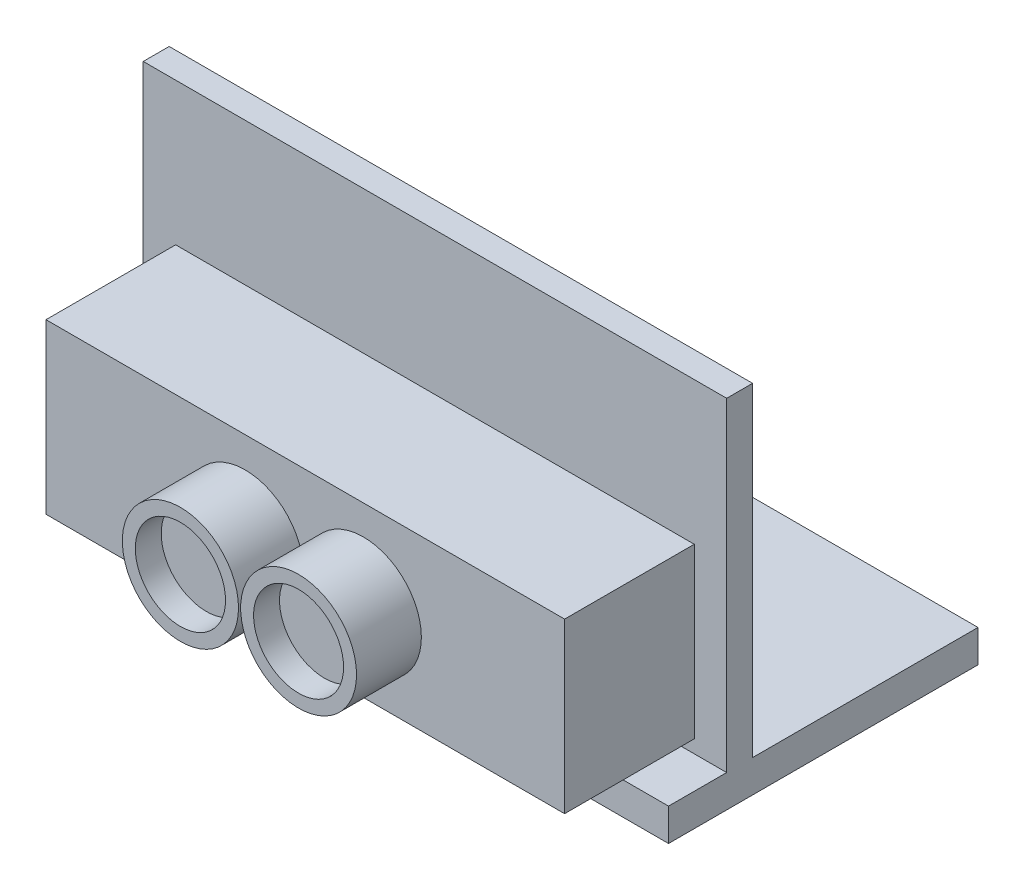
ISO-10303-21;
HEADER;
FILE_DESCRIPTION(('STEP AP214'),'2;1');
FILE_NAME('part.step','',(''),(''),'','','');
FILE_SCHEMA(('AUTOMOTIVE_DESIGN { 1 0 10303 214 1 1 1 1 }'));
ENDSEC;
DATA;
#1=APPLICATION_CONTEXT('core data for automotive mechanical design processes');
#2=APPLICATION_PROTOCOL_DEFINITION('international standard','automotive_design',2000,#1);
#3=PRODUCT_CONTEXT('',#1,'mechanical');
#4=PRODUCT('Part','Part','',(#3));
#5=PRODUCT_RELATED_PRODUCT_CATEGORY('part','',(#4));
#6=PRODUCT_DEFINITION_FORMATION('','',#4);
#7=PRODUCT_DEFINITION_CONTEXT('part definition',#1,'design');
#8=PRODUCT_DEFINITION('design','',#6,#7);
#9=PRODUCT_DEFINITION_SHAPE('','',#8);
#10=(LENGTH_UNIT() NAMED_UNIT(*) SI_UNIT(.MILLI.,.METRE.));
#11=(NAMED_UNIT(*) PLANE_ANGLE_UNIT() SI_UNIT($,.RADIAN.));
#12=(NAMED_UNIT(*) SI_UNIT($,.STERADIAN.) SOLID_ANGLE_UNIT());
#13=UNCERTAINTY_MEASURE_WITH_UNIT(LENGTH_MEASURE(1.E-05),#10,'distance_accuracy_value','');
#14=(GEOMETRIC_REPRESENTATION_CONTEXT(3) GLOBAL_UNCERTAINTY_ASSIGNED_CONTEXT((#13)) GLOBAL_UNIT_ASSIGNED_CONTEXT((#10,
#11,#12)) REPRESENTATION_CONTEXT('',''));
#15=CARTESIAN_POINT('',(0.,0.,0.));
#16=DIRECTION('',(0.,0.,1.));
#17=DIRECTION('',(1.,0.,0.));
#18=AXIS2_PLACEMENT_3D('',#15,#16,#17);
#19=CARTESIAN_POINT('',(0.,0.,2.));
#20=DIRECTION('',(0.,0.,1.));
#21=DIRECTION('',(1.,0.,0.));
#22=AXIS2_PLACEMENT_3D('',#19,#20,#21);
#23=PLANE('',#22);
#24=DIRECTION('',(0.,1.,0.));
#25=VECTOR('',#24,1.);
#26=CARTESIAN_POINT('',(22.5,12.5,2.));
#27=LINE('',#26,#25);
#28=CARTESIAN_POINT('',(22.5,-12.5,2.));
#29=VERTEX_POINT('',#28);
#30=CARTESIAN_POINT('',(22.5,12.5,2.));
#31=VERTEX_POINT('',#30);
#32=EDGE_CURVE('E242',#29,#31,#27,.T.);
#33=ORIENTED_EDGE('',*,*,#32,.T.);
#34=DIRECTION('',(-1.,0.,0.));
#35=VECTOR('',#34,1.);
#36=CARTESIAN_POINT('',(-22.5,12.5,2.));
#37=LINE('',#36,#35);
#38=CARTESIAN_POINT('',(-22.5,12.5,2.));
#39=VERTEX_POINT('',#38);
#40=EDGE_CURVE('E85',#31,#39,#37,.T.);
#41=ORIENTED_EDGE('',*,*,#40,.T.);
#42=DIRECTION('',(0.,-1.,0.));
#43=VECTOR('',#42,1.);
#44=CARTESIAN_POINT('',(-22.5,12.5,2.));
#45=LINE('',#44,#43);
#46=CARTESIAN_POINT('',(-22.5,-12.5,1.99999999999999));
#47=VERTEX_POINT('',#46);
#48=EDGE_CURVE('E248',#39,#47,#45,.T.);
#49=ORIENTED_EDGE('',*,*,#48,.T.);
#50=DIRECTION('',(1.,0.,0.));
#51=VECTOR('',#50,1.);
#52=CARTESIAN_POINT('',(-22.5,-12.5,2.));
#53=LINE('',#52,#51);
#54=EDGE_CURVE('E252',#47,#29,#53,.T.);
#55=ORIENTED_EDGE('',*,*,#54,.T.);
#56=EDGE_LOOP('',(#33,#41,#49,#55));
#57=FACE_BOUND('',#56,.T.);
#58=DIRECTION('',(-1.,0.,0.));
#59=VECTOR('',#58,1.);
#60=CARTESIAN_POINT('',(-20.,1.5,2.));
#61=LINE('',#60,#59);
#62=CARTESIAN_POINT('',(20.,1.5,2.));
#63=VERTEX_POINT('',#62);
#64=CARTESIAN_POINT('',(-20.,1.5,2.));
#65=VERTEX_POINT('',#64);
#66=EDGE_CURVE('E221',#63,#65,#61,.T.);
#67=ORIENTED_EDGE('',*,*,#66,.F.);
#68=DIRECTION('',(0.,1.,0.));
#69=VECTOR('',#68,1.);
#70=CARTESIAN_POINT('',(20.,1.5,2.));
#71=LINE('',#70,#69);
#72=CARTESIAN_POINT('',(20.,-11.5,2.));
#73=VERTEX_POINT('',#72);
#74=EDGE_CURVE('E201',#73,#63,#71,.T.);
#75=ORIENTED_EDGE('',*,*,#74,.F.);
#76=DIRECTION('',(1.,0.,0.));
#77=VECTOR('',#76,1.);
#78=CARTESIAN_POINT('',(-20.,-11.5,2.));
#79=LINE('',#78,#77);
#80=CARTESIAN_POINT('',(-20.,-11.5,2.));
#81=VERTEX_POINT('',#80);
#82=EDGE_CURVE('E208',#81,#73,#79,.T.);
#83=ORIENTED_EDGE('',*,*,#82,.F.);
#84=DIRECTION('',(0.,-1.,0.));
#85=VECTOR('',#84,1.);
#86=CARTESIAN_POINT('',(-20.,1.5,2.));
#87=LINE('',#86,#85);
#88=EDGE_CURVE('E224',#65,#81,#87,.T.);
#89=ORIENTED_EDGE('',*,*,#88,.F.);
#90=EDGE_LOOP('',(#67,#75,#83,#89));
#91=FACE_BOUND('',#90,.T.);
#92=ADVANCED_FACE('F41',(#57,#91),#23,.T.);
#93=CARTESIAN_POINT('',(22.5,12.5,2.));
#94=DIRECTION('',(-1.,0.,0.));
#95=DIRECTION('',(0.,-1.,0.));
#96=AXIS2_PLACEMENT_3D('',#93,#94,#95);
#97=PLANE('',#96);
#98=DIRECTION('',(0.,1.,0.));
#99=VECTOR('',#98,1.);
#100=CARTESIAN_POINT('',(22.5,12.5,0.));
#101=LINE('',#100,#99);
#102=CARTESIAN_POINT('',(22.5,-12.5,0.));
#103=VERTEX_POINT('',#102);
#104=CARTESIAN_POINT('',(22.5,12.5,0.));
#105=VERTEX_POINT('',#104);
#106=EDGE_CURVE('E241',#103,#105,#101,.T.);
#107=ORIENTED_EDGE('',*,*,#106,.T.);
#108=DIRECTION('',(0.,0.,-1.));
#109=VECTOR('',#108,1.);
#110=CARTESIAN_POINT('',(22.5,12.5,2.));
#111=LINE('',#110,#109);
#112=EDGE_CURVE('E45',#31,#105,#111,.T.);
#113=ORIENTED_EDGE('',*,*,#112,.F.);
#114=ORIENTED_EDGE('',*,*,#32,.F.);
#115=DIRECTION('',(0.,0.,1.));
#116=VECTOR('',#115,1.);
#117=CARTESIAN_POINT('',(22.5,-12.5,-17.3854720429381));
#118=LINE('',#117,#116);
#119=CARTESIAN_POINT('',(22.5,-12.5,6.48512200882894));
#120=VERTEX_POINT('',#119);
#121=EDGE_CURVE('E67',#29,#120,#118,.T.);
#122=ORIENTED_EDGE('',*,*,#121,.T.);
#123=DIRECTION('',(0.,1.,0.));
#124=VECTOR('',#123,1.);
#125=CARTESIAN_POINT('',(22.5,-15.,6.48512200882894));
#126=LINE('',#125,#124);
#127=CARTESIAN_POINT('',(22.5,-15.,6.48512200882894));
#128=VERTEX_POINT('',#127);
#129=EDGE_CURVE('E175',#128,#120,#126,.T.);
#130=ORIENTED_EDGE('',*,*,#129,.F.);
#131=DIRECTION('',(0.,0.,1.));
#132=VECTOR('',#131,1.);
#133=CARTESIAN_POINT('',(22.5,-15.,-17.3854720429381));
#134=LINE('',#133,#132);
#135=CARTESIAN_POINT('',(22.5,-15.,-17.3854720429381));
#136=VERTEX_POINT('',#135);
#137=EDGE_CURVE('E150',#136,#128,#134,.T.);
#138=ORIENTED_EDGE('',*,*,#137,.F.);
#139=DIRECTION('',(0.,1.,0.));
#140=VECTOR('',#139,1.);
#141=CARTESIAN_POINT('',(22.5,-15.,-17.3854720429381));
#142=LINE('',#141,#140);
#143=CARTESIAN_POINT('',(22.5,-12.5,-17.3854720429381));
#144=VERTEX_POINT('',#143);
#145=EDGE_CURVE('E146',#136,#144,#142,.T.);
#146=ORIENTED_EDGE('',*,*,#145,.T.);
#147=EDGE_CURVE('E276',#144,#103,#118,.T.);
#148=ORIENTED_EDGE('',*,*,#147,.T.);
#149=EDGE_LOOP('',(#107,#113,#114,#122,#130,#138,#146,#148));
#150=FACE_BOUND('',#149,.T.);
#151=ADVANCED_FACE('F43',(#150),#97,.F.);
#152=CARTESIAN_POINT('',(-22.5,12.5,2.));
#153=DIRECTION('',(0.,-1.,0.));
#154=DIRECTION('',(0.,0.,-1.));
#155=AXIS2_PLACEMENT_3D('',#152,#153,#154);
#156=PLANE('',#155);
#157=DIRECTION('',(-1.,0.,0.));
#158=VECTOR('',#157,1.);
#159=CARTESIAN_POINT('',(-22.5,12.5,0.));
#160=LINE('',#159,#158);
#161=CARTESIAN_POINT('',(-22.5,12.5,0.));
#162=VERTEX_POINT('',#161);
#163=EDGE_CURVE('E82',#105,#162,#160,.T.);
#164=ORIENTED_EDGE('',*,*,#163,.T.);
#165=DIRECTION('',(0.,0.,-1.));
#166=VECTOR('',#165,1.);
#167=CARTESIAN_POINT('',(-22.5,12.5,2.));
#168=LINE('',#167,#166);
#169=EDGE_CURVE('E255',#39,#162,#168,.T.);
#170=ORIENTED_EDGE('',*,*,#169,.F.);
#171=ORIENTED_EDGE('',*,*,#40,.F.);
#172=ORIENTED_EDGE('',*,*,#112,.T.);
#173=EDGE_LOOP('',(#164,#170,#171,#172));
#174=FACE_BOUND('',#173,.T.);
#175=ADVANCED_FACE('F270',(#174),#156,.F.);
#176=CARTESIAN_POINT('',(-22.5,12.5,2.));
#177=DIRECTION('',(1.,0.,0.));
#178=DIRECTION('',(0.,1.,0.));
#179=AXIS2_PLACEMENT_3D('',#176,#177,#178);
#180=PLANE('',#179);
#181=DIRECTION('',(0.,-1.,0.));
#182=VECTOR('',#181,1.);
#183=CARTESIAN_POINT('',(-22.5,12.5,0.));
#184=LINE('',#183,#182);
#185=CARTESIAN_POINT('',(-22.5,-12.5,0.));
#186=VERTEX_POINT('',#185);
#187=EDGE_CURVE('E261',#162,#186,#184,.T.);
#188=ORIENTED_EDGE('',*,*,#187,.T.);
#189=DIRECTION('',(0.,0.,-1.));
#190=VECTOR('',#189,1.);
#191=CARTESIAN_POINT('',(-22.5,-12.5,-17.3854720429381));
#192=LINE('',#191,#190);
#193=CARTESIAN_POINT('',(-22.5,-12.5,-17.3854720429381));
#194=VERTEX_POINT('',#193);
#195=EDGE_CURVE('E165',#186,#194,#192,.T.);
#196=ORIENTED_EDGE('',*,*,#195,.T.);
#197=DIRECTION('',(0.,1.,0.));
#198=VECTOR('',#197,1.);
#199=CARTESIAN_POINT('',(-22.5,-15.,-17.3854720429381));
#200=LINE('',#199,#198);
#201=CARTESIAN_POINT('',(-22.5,-15.,-17.3854720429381));
#202=VERTEX_POINT('',#201);
#203=EDGE_CURVE('E144',#202,#194,#200,.T.);
#204=ORIENTED_EDGE('',*,*,#203,.F.);
#205=DIRECTION('',(0.,0.,-1.));
#206=VECTOR('',#205,1.);
#207=CARTESIAN_POINT('',(-22.5,-15.,-17.3854720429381));
#208=LINE('',#207,#206);
#209=CARTESIAN_POINT('',(-22.5,-15.,6.48512200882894));
#210=VERTEX_POINT('',#209);
#211=EDGE_CURVE('E151',#210,#202,#208,.T.);
#212=ORIENTED_EDGE('',*,*,#211,.F.);
#213=DIRECTION('',(0.,1.,0.));
#214=VECTOR('',#213,1.);
#215=CARTESIAN_POINT('',(-22.5,-15.,6.48512200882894));
#216=LINE('',#215,#214);
#217=CARTESIAN_POINT('',(-22.5,-12.5,6.48512200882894));
#218=VERTEX_POINT('',#217);
#219=EDGE_CURVE('E302',#210,#218,#216,.T.);
#220=ORIENTED_EDGE('',*,*,#219,.T.);
#221=EDGE_CURVE('E284',#218,#47,#192,.T.);
#222=ORIENTED_EDGE('',*,*,#221,.T.);
#223=ORIENTED_EDGE('',*,*,#48,.F.);
#224=ORIENTED_EDGE('',*,*,#169,.T.);
#225=EDGE_LOOP('',(#188,#196,#204,#212,#220,#222,#223,#224));
#226=FACE_BOUND('',#225,.T.);
#227=ADVANCED_FACE('F164',(#226),#180,.F.);
#228=CARTESIAN_POINT('',(0.,0.,0.));
#229=DIRECTION('',(0.,0.,1.));
#230=DIRECTION('',(1.,0.,0.));
#231=AXIS2_PLACEMENT_3D('',#228,#229,#230);
#232=PLANE('',#231);
#233=ORIENTED_EDGE('',*,*,#106,.F.);
#234=DIRECTION('',(1.,0.,0.));
#235=VECTOR('',#234,1.);
#236=CARTESIAN_POINT('',(-22.5,-12.5,0.));
#237=LINE('',#236,#235);
#238=EDGE_CURVE('E245',#186,#103,#237,.T.);
#239=ORIENTED_EDGE('',*,*,#238,.F.);
#240=ORIENTED_EDGE('',*,*,#187,.F.);
#241=ORIENTED_EDGE('',*,*,#163,.F.);
#242=EDGE_LOOP('',(#233,#239,#240,#241));
#243=FACE_BOUND('',#242,.T.);
#244=ADVANCED_FACE('F279',(#243),#232,.F.);
#245=CARTESIAN_POINT('',(20.,1.5,12.));
#246=DIRECTION('',(-1.,0.,0.));
#247=DIRECTION('',(0.,0.,1.));
#248=AXIS2_PLACEMENT_3D('',#245,#246,#247);
#249=PLANE('',#248);
#250=ORIENTED_EDGE('',*,*,#74,.T.);
#251=DIRECTION('',(0.,0.,-1.));
#252=VECTOR('',#251,1.);
#253=CARTESIAN_POINT('',(20.,1.5,12.));
#254=LINE('',#253,#252);
#255=CARTESIAN_POINT('',(20.,1.5,12.));
#256=VERTEX_POINT('',#255);
#257=EDGE_CURVE('E238',#256,#63,#254,.T.);
#258=ORIENTED_EDGE('',*,*,#257,.F.);
#259=DIRECTION('',(0.,1.,0.));
#260=VECTOR('',#259,1.);
#261=CARTESIAN_POINT('',(20.,1.5,12.));
#262=LINE('',#261,#260);
#263=CARTESIAN_POINT('',(20.,-11.5,12.));
#264=VERTEX_POINT('',#263);
#265=EDGE_CURVE('E203',#264,#256,#262,.T.);
#266=ORIENTED_EDGE('',*,*,#265,.F.);
#267=DIRECTION('',(0.,0.,-1.));
#268=VECTOR('',#267,1.);
#269=CARTESIAN_POINT('',(20.,-11.5,12.));
#270=LINE('',#269,#268);
#271=EDGE_CURVE('E217',#264,#73,#270,.T.);
#272=ORIENTED_EDGE('',*,*,#271,.T.);
#273=EDGE_LOOP('',(#250,#258,#266,#272));
#274=FACE_BOUND('',#273,.T.);
#275=ADVANCED_FACE('F343',(#274),#249,.F.);
#276=CARTESIAN_POINT('',(-20.,1.5,12.));
#277=DIRECTION('',(0.,-1.,0.));
#278=DIRECTION('',(0.,0.,-1.));
#279=AXIS2_PLACEMENT_3D('',#276,#277,#278);
#280=PLANE('',#279);
#281=ORIENTED_EDGE('',*,*,#66,.T.);
#282=DIRECTION('',(0.,0.,-1.));
#283=VECTOR('',#282,1.);
#284=CARTESIAN_POINT('',(-20.,1.5,12.));
#285=LINE('',#284,#283);
#286=CARTESIAN_POINT('',(-20.,1.5,12.));
#287=VERTEX_POINT('',#286);
#288=EDGE_CURVE('E234',#287,#65,#285,.T.);
#289=ORIENTED_EDGE('',*,*,#288,.F.);
#290=DIRECTION('',(-1.,0.,0.));
#291=VECTOR('',#290,1.);
#292=CARTESIAN_POINT('',(-20.,1.5,12.));
#293=LINE('',#292,#291);
#294=EDGE_CURVE('E207',#256,#287,#293,.T.);
#295=ORIENTED_EDGE('',*,*,#294,.F.);
#296=ORIENTED_EDGE('',*,*,#257,.T.);
#297=EDGE_LOOP('',(#281,#289,#295,#296));
#298=FACE_BOUND('',#297,.T.);
#299=ADVANCED_FACE('F368',(#298),#280,.F.);
#300=CARTESIAN_POINT('',(-20.,1.5,12.));
#301=DIRECTION('',(1.,0.,0.));
#302=DIRECTION('',(0.,1.,0.));
#303=AXIS2_PLACEMENT_3D('',#300,#301,#302);
#304=PLANE('',#303);
#305=ORIENTED_EDGE('',*,*,#88,.T.);
#306=DIRECTION('',(0.,0.,-1.));
#307=VECTOR('',#306,1.);
#308=CARTESIAN_POINT('',(-20.,-11.5,12.));
#309=LINE('',#308,#307);
#310=CARTESIAN_POINT('',(-20.,-11.5,12.));
#311=VERTEX_POINT('',#310);
#312=EDGE_CURVE('E58',#311,#81,#309,.T.);
#313=ORIENTED_EDGE('',*,*,#312,.F.);
#314=DIRECTION('',(0.,-1.,0.));
#315=VECTOR('',#314,1.);
#316=CARTESIAN_POINT('',(-20.,1.5,12.));
#317=LINE('',#316,#315);
#318=EDGE_CURVE('E211',#287,#311,#317,.T.);
#319=ORIENTED_EDGE('',*,*,#318,.F.);
#320=ORIENTED_EDGE('',*,*,#288,.T.);
#321=EDGE_LOOP('',(#305,#313,#319,#320));
#322=FACE_BOUND('',#321,.T.);
#323=ADVANCED_FACE('F375',(#322),#304,.F.);
#324=CARTESIAN_POINT('',(-20.,-11.5,12.));
#325=DIRECTION('',(0.,1.,0.));
#326=DIRECTION('',(0.,0.,1.));
#327=AXIS2_PLACEMENT_3D('',#324,#325,#326);
#328=PLANE('',#327);
#329=ORIENTED_EDGE('',*,*,#82,.T.);
#330=ORIENTED_EDGE('',*,*,#271,.F.);
#331=DIRECTION('',(1.,0.,0.));
#332=VECTOR('',#331,1.);
#333=CARTESIAN_POINT('',(-20.,-11.5,12.));
#334=LINE('',#333,#332);
#335=EDGE_CURVE('E214',#311,#264,#334,.T.);
#336=ORIENTED_EDGE('',*,*,#335,.F.);
#337=ORIENTED_EDGE('',*,*,#312,.T.);
#338=EDGE_LOOP('',(#329,#330,#336,#337));
#339=FACE_BOUND('',#338,.T.);
#340=ADVANCED_FACE('F382',(#339),#328,.F.);
#341=CARTESIAN_POINT('',(0.,0.,12.));
#342=DIRECTION('',(0.,0.,1.));
#343=DIRECTION('',(1.,0.,0.));
#344=AXIS2_PLACEMENT_3D('',#341,#342,#343);
#345=PLANE('',#344);
#346=CARTESIAN_POINT('',(-4.63299444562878,-5.33090468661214,12.));
#347=DIRECTION('',(0.,0.,1.));
#348=DIRECTION('',(1.,0.,0.));
#349=AXIS2_PLACEMENT_3D('',#346,#347,#348);
#350=CIRCLE('',#349,4.48016591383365);
#351=CARTESIAN_POINT('',(-0.15282853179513,-5.33090468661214,12.));
#352=VERTEX_POINT('',#351);
#353=EDGE_CURVE('E183',#352,#352,#350,.T.);
#354=ORIENTED_EDGE('',*,*,#353,.F.);
#355=EDGE_LOOP('',(#354));
#356=FACE_BOUND('',#355,.T.);
#357=CARTESIAN_POINT('',(4.48185602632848,-5.24068472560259,12.));
#358=DIRECTION('',(0.,0.,1.));
#359=DIRECTION('',(1.,0.,0.));
#360=AXIS2_PLACEMENT_3D('',#357,#358,#359);
#361=CIRCLE('',#360,4.46981720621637);
#362=CARTESIAN_POINT('',(8.95167323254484,-5.24068472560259,12.));
#363=VERTEX_POINT('',#362);
#364=EDGE_CURVE('E11',#363,#363,#361,.T.);
#365=ORIENTED_EDGE('',*,*,#364,.F.);
#366=EDGE_LOOP('',(#365));
#367=FACE_BOUND('',#366,.T.);
#368=ORIENTED_EDGE('',*,*,#265,.T.);
#369=ORIENTED_EDGE('',*,*,#294,.T.);
#370=ORIENTED_EDGE('',*,*,#318,.T.);
#371=ORIENTED_EDGE('',*,*,#335,.T.);
#372=EDGE_LOOP('',(#368,#369,#370,#371));
#373=FACE_BOUND('',#372,.T.);
#374=ADVANCED_FACE('F390',(#356,#367,#373),#345,.T.);
#375=CARTESIAN_POINT('',(4.48185602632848,-5.24068472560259,17.));
#376=DIRECTION('',(0.,0.,-1.));
#377=DIRECTION('',(-1.,0.,0.));
#378=AXIS2_PLACEMENT_3D('',#375,#376,#377);
#379=CYLINDRICAL_SURFACE('',#378,4.46981720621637);
#380=CARTESIAN_POINT('',(4.48185602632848,-5.24068472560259,17.));
#381=DIRECTION('',(0.,0.,1.));
#382=DIRECTION('',(1.,0.,0.));
#383=AXIS2_PLACEMENT_3D('',#380,#381,#382);
#384=CIRCLE('',#383,4.46981720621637);
#385=CARTESIAN_POINT('',(8.95167323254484,-5.24068472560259,17.));
#386=VERTEX_POINT('',#385);
#387=EDGE_CURVE('E195',#386,#386,#384,.T.);
#388=ORIENTED_EDGE('',*,*,#387,.F.);
#389=EDGE_LOOP('',(#388));
#390=FACE_BOUND('',#389,.T.);
#391=ORIENTED_EDGE('',*,*,#364,.T.);
#392=EDGE_LOOP('',(#391));
#393=FACE_BOUND('',#392,.T.);
#394=ADVANCED_FACE('F397',(#390,#393),#379,.T.);
#395=CARTESIAN_POINT('',(4.48185602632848,-5.24068472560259,17.));
#396=DIRECTION('',(0.,0.,1.));
#397=DIRECTION('',(1.,0.,0.));
#398=AXIS2_PLACEMENT_3D('',#395,#396,#397);
#399=PLANE('',#398);
#400=CARTESIAN_POINT('',(4.48185602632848,-5.24068472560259,17.));
#401=DIRECTION('',(0.,0.,1.));
#402=DIRECTION('',(1.,0.,0.));
#403=AXIS2_PLACEMENT_3D('',#400,#401,#402);
#404=CIRCLE('',#403,3.46981720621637);
#405=CARTESIAN_POINT('',(7.95167323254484,-5.24068472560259,17.));
#406=VERTEX_POINT('',#405);
#407=EDGE_CURVE('E184',#406,#406,#404,.T.);
#408=ORIENTED_EDGE('',*,*,#407,.F.);
#409=EDGE_LOOP('',(#408));
#410=FACE_BOUND('',#409,.T.);
#411=ORIENTED_EDGE('',*,*,#387,.T.);
#412=EDGE_LOOP('',(#411));
#413=FACE_BOUND('',#412,.T.);
#414=ADVANCED_FACE('F405',(#410,#413),#399,.T.);
#415=CARTESIAN_POINT('',(-4.63299444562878,-5.33090468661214,17.));
#416=DIRECTION('',(0.,0.,-1.));
#417=DIRECTION('',(-1.,0.,0.));
#418=AXIS2_PLACEMENT_3D('',#415,#416,#417);
#419=CYLINDRICAL_SURFACE('',#418,4.48016591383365);
#420=CARTESIAN_POINT('',(-4.63299444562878,-5.33090468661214,17.));
#421=DIRECTION('',(0.,0.,1.));
#422=DIRECTION('',(1.,0.,0.));
#423=AXIS2_PLACEMENT_3D('',#420,#421,#422);
#424=CIRCLE('',#423,4.48016591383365);
#425=CARTESIAN_POINT('',(-0.15282853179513,-5.33090468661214,17.));
#426=VERTEX_POINT('',#425);
#427=EDGE_CURVE('E191',#426,#426,#424,.T.);
#428=ORIENTED_EDGE('',*,*,#427,.F.);
#429=EDGE_LOOP('',(#428));
#430=FACE_BOUND('',#429,.T.);
#431=ORIENTED_EDGE('',*,*,#353,.T.);
#432=EDGE_LOOP('',(#431));
#433=FACE_BOUND('',#432,.T.);
#434=ADVANCED_FACE('F414',(#430,#433),#419,.T.);
#435=CARTESIAN_POINT('',(-4.63299444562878,-5.33090468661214,17.));
#436=DIRECTION('',(0.,0.,1.));
#437=DIRECTION('',(1.,0.,0.));
#438=AXIS2_PLACEMENT_3D('',#435,#436,#437);
#439=PLANE('',#438);
#440=CARTESIAN_POINT('',(-4.63299444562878,-5.33090468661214,17.));
#441=DIRECTION('',(0.,0.,1.));
#442=DIRECTION('',(1.,0.,0.));
#443=AXIS2_PLACEMENT_3D('',#440,#441,#442);
#444=CIRCLE('',#443,3.48016591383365);
#445=CARTESIAN_POINT('',(-1.15282853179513,-5.33090468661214,17.));
#446=VERTEX_POINT('',#445);
#447=EDGE_CURVE('E168',#446,#446,#444,.T.);
#448=ORIENTED_EDGE('',*,*,#447,.F.);
#449=EDGE_LOOP('',(#448));
#450=FACE_BOUND('',#449,.T.);
#451=ORIENTED_EDGE('',*,*,#427,.T.);
#452=EDGE_LOOP('',(#451));
#453=FACE_BOUND('',#452,.T.);
#454=ADVANCED_FACE('F422',(#450,#453),#439,.T.);
#455=CARTESIAN_POINT('',(-4.63299444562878,-5.33090468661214,15.));
#456=DIRECTION('',(0.,0.,1.));
#457=DIRECTION('',(1.,0.,0.));
#458=AXIS2_PLACEMENT_3D('',#455,#456,#457);
#459=CYLINDRICAL_SURFACE('',#458,3.48016591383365);
#460=CARTESIAN_POINT('',(-4.63299444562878,-5.33090468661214,15.));
#461=DIRECTION('',(0.,0.,1.));
#462=DIRECTION('',(1.,0.,0.));
#463=AXIS2_PLACEMENT_3D('',#460,#461,#462);
#464=CIRCLE('',#463,3.48016591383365);
#465=CARTESIAN_POINT('',(-1.15282853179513,-5.33090468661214,15.));
#466=VERTEX_POINT('',#465);
#467=EDGE_CURVE('E173',#466,#466,#464,.T.);
#468=ORIENTED_EDGE('',*,*,#467,.F.);
#469=EDGE_LOOP('',(#468));
#470=FACE_BOUND('',#469,.T.);
#471=ORIENTED_EDGE('',*,*,#447,.T.);
#472=EDGE_LOOP('',(#471));
#473=FACE_BOUND('',#472,.T.);
#474=ADVANCED_FACE('F429',(#470,#473),#459,.F.);
#475=CARTESIAN_POINT('',(-4.63299444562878,-5.33090468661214,15.));
#476=DIRECTION('',(0.,0.,1.));
#477=DIRECTION('',(1.,0.,0.));
#478=AXIS2_PLACEMENT_3D('',#475,#476,#477);
#479=PLANE('',#478);
#480=ORIENTED_EDGE('',*,*,#467,.T.);
#481=EDGE_LOOP('',(#480));
#482=FACE_BOUND('',#481,.T.);
#483=ADVANCED_FACE('F437',(#482),#479,.T.);
#484=CARTESIAN_POINT('',(4.48185602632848,-5.24068472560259,15.));
#485=DIRECTION('',(0.,0.,1.));
#486=DIRECTION('',(1.,0.,0.));
#487=AXIS2_PLACEMENT_3D('',#484,#485,#486);
#488=CYLINDRICAL_SURFACE('',#487,3.46981720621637);
#489=CARTESIAN_POINT('',(4.48185602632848,-5.24068472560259,15.));
#490=DIRECTION('',(0.,0.,1.));
#491=DIRECTION('',(1.,0.,0.));
#492=AXIS2_PLACEMENT_3D('',#489,#490,#491);
#493=CIRCLE('',#492,3.46981720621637);
#494=CARTESIAN_POINT('',(7.95167323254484,-5.24068472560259,15.));
#495=VERTEX_POINT('',#494);
#496=EDGE_CURVE('E179',#495,#495,#493,.T.);
#497=ORIENTED_EDGE('',*,*,#496,.F.);
#498=EDGE_LOOP('',(#497));
#499=FACE_BOUND('',#498,.T.);
#500=ORIENTED_EDGE('',*,*,#407,.T.);
#501=EDGE_LOOP('',(#500));
#502=FACE_BOUND('',#501,.T.);
#503=ADVANCED_FACE('F445',(#499,#502),#488,.F.);
#504=CARTESIAN_POINT('',(4.48185602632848,-5.24068472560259,15.));
#505=DIRECTION('',(0.,0.,1.));
#506=DIRECTION('',(1.,0.,0.));
#507=AXIS2_PLACEMENT_3D('',#504,#505,#506);
#508=PLANE('',#507);
#509=ORIENTED_EDGE('',*,*,#496,.T.);
#510=EDGE_LOOP('',(#509));
#511=FACE_BOUND('',#510,.T.);
#512=ADVANCED_FACE('F335',(#511),#508,.T.);
#513=CARTESIAN_POINT('',(0.,-12.5,0.));
#514=DIRECTION('',(0.,1.,0.));
#515=DIRECTION('',(0.,0.,1.));
#516=AXIS2_PLACEMENT_3D('',#513,#514,#515);
#517=PLANE('',#516);
#518=ORIENTED_EDGE('',*,*,#54,.F.);
#519=ORIENTED_EDGE('',*,*,#221,.F.);
#520=DIRECTION('',(-1.,0.,0.));
#521=VECTOR('',#520,1.);
#522=CARTESIAN_POINT('',(-22.5,-12.5,6.48512200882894));
#523=LINE('',#522,#521);
#524=EDGE_CURVE('E161',#120,#218,#523,.T.);
#525=ORIENTED_EDGE('',*,*,#524,.F.);
#526=ORIENTED_EDGE('',*,*,#121,.F.);
#527=EDGE_LOOP('',(#518,#519,#525,#526));
#528=FACE_BOUND('',#527,.T.);
#529=ADVANCED_FACE('F310',(#528),#517,.T.);
#530=CARTESIAN_POINT('',(-22.5,-15.,-17.3854720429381));
#531=DIRECTION('',(0.,0.,1.));
#532=DIRECTION('',(1.,0.,0.));
#533=AXIS2_PLACEMENT_3D('',#530,#531,#532);
#534=PLANE('',#533);
#535=DIRECTION('',(1.,0.,0.));
#536=VECTOR('',#535,1.);
#537=CARTESIAN_POINT('',(-22.5,-12.5,-17.3854720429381));
#538=LINE('',#537,#536);
#539=EDGE_CURVE('E282',#194,#144,#538,.T.);
#540=ORIENTED_EDGE('',*,*,#539,.T.);
#541=ORIENTED_EDGE('',*,*,#145,.F.);
#542=DIRECTION('',(1.,0.,0.));
#543=VECTOR('',#542,1.);
#544=CARTESIAN_POINT('',(-22.5,-15.,-17.3854720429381));
#545=LINE('',#544,#543);
#546=EDGE_CURVE('E140',#202,#136,#545,.T.);
#547=ORIENTED_EDGE('',*,*,#546,.F.);
#548=ORIENTED_EDGE('',*,*,#203,.T.);
#549=EDGE_LOOP('',(#540,#541,#547,#548));
#550=FACE_BOUND('',#549,.T.);
#551=ADVANCED_FACE('F142',(#550),#534,.F.);
#552=CARTESIAN_POINT('',(-22.5,-15.,6.48512200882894));
#553=DIRECTION('',(0.,0.,-1.));
#554=DIRECTION('',(-1.,0.,0.));
#555=AXIS2_PLACEMENT_3D('',#552,#553,#554);
#556=PLANE('',#555);
#557=ORIENTED_EDGE('',*,*,#524,.T.);
#558=ORIENTED_EDGE('',*,*,#219,.F.);
#559=DIRECTION('',(-1.,0.,0.));
#560=VECTOR('',#559,1.);
#561=CARTESIAN_POINT('',(-22.5,-15.,6.48512200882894));
#562=LINE('',#561,#560);
#563=EDGE_CURVE('E156',#128,#210,#562,.T.);
#564=ORIENTED_EDGE('',*,*,#563,.F.);
#565=ORIENTED_EDGE('',*,*,#129,.T.);
#566=EDGE_LOOP('',(#557,#558,#564,#565));
#567=FACE_BOUND('',#566,.T.);
#568=ADVANCED_FACE('F308',(#567),#556,.F.);
#569=CARTESIAN_POINT('',(0.,-15.,0.));
#570=DIRECTION('',(0.,1.,0.));
#571=DIRECTION('',(0.,0.,1.));
#572=AXIS2_PLACEMENT_3D('',#569,#570,#571);
#573=PLANE('',#572);
#574=CARTESIAN_POINT('',(-0.15282853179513,-15.,-13.7481458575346));
#575=DIRECTION('',(0.,1.,0.));
#576=DIRECTION('',(0.,0.,1.));
#577=AXIS2_PLACEMENT_3D('',#574,#575,#576);
#578=CIRCLE('',#577,1.5);
#579=CARTESIAN_POINT('',(-0.15282853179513,-15.,-12.2481458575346));
#580=VERTEX_POINT('',#579);
#581=EDGE_CURVE('E285',#580,#580,#578,.T.);
#582=ORIENTED_EDGE('',*,*,#581,.T.);
#583=EDGE_LOOP('',(#582));
#584=FACE_BOUND('',#583,.T.);
#585=ORIENTED_EDGE('',*,*,#211,.T.);
#586=ORIENTED_EDGE('',*,*,#546,.T.);
#587=ORIENTED_EDGE('',*,*,#137,.T.);
#588=ORIENTED_EDGE('',*,*,#563,.T.);
#589=EDGE_LOOP('',(#585,#586,#587,#588));
#590=FACE_BOUND('',#589,.T.);
#591=ADVANCED_FACE('F154',(#584,#590),#573,.F.);
#592=CARTESIAN_POINT('',(-0.15282853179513,-12.5,-13.7481458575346));
#593=DIRECTION('',(0.,1.,0.));
#594=DIRECTION('',(0.,0.,1.));
#595=AXIS2_PLACEMENT_3D('',#592,#593,#594);
#596=CIRCLE('',#595,1.5);
#597=CARTESIAN_POINT('',(-0.15282853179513,-12.5,-12.2481458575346));
#598=VERTEX_POINT('',#597);
#599=EDGE_CURVE('E291',#598,#598,#596,.T.);
#600=ORIENTED_EDGE('',*,*,#599,.F.);
#601=EDGE_LOOP('',(#600));
#602=FACE_BOUND('',#601,.T.);
#603=ORIENTED_EDGE('',*,*,#195,.F.);
#604=ORIENTED_EDGE('',*,*,#238,.T.);
#605=ORIENTED_EDGE('',*,*,#147,.F.);
#606=ORIENTED_EDGE('',*,*,#539,.F.);
#607=EDGE_LOOP('',(#603,#604,#605,#606));
#608=FACE_BOUND('',#607,.T.);
#609=ADVANCED_FACE('F281',(#602,#608),#517,.T.);
#610=CARTESIAN_POINT('',(-0.15282853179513,-15.,-13.7481458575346));
#611=DIRECTION('',(0.,1.,0.));
#612=DIRECTION('',(0.,0.,1.));
#613=AXIS2_PLACEMENT_3D('',#610,#611,#612);
#614=CYLINDRICAL_SURFACE('',#613,1.5);
#615=ORIENTED_EDGE('',*,*,#581,.F.);
#616=EDGE_LOOP('',(#615));
#617=FACE_BOUND('',#616,.T.);
#618=ORIENTED_EDGE('',*,*,#599,.T.);
#619=EDGE_LOOP('',(#618));
#620=FACE_BOUND('',#619,.T.);
#621=ADVANCED_FACE('F321',(#617,#620),#614,.F.);
#622=CLOSED_SHELL('',(#92,#151,#175,#227,#244,#275,#299,#323,#340,#374,#394,#414,#434,#454,#474,
#483,#503,#512,#529,#551,#568,#591,#609,#621));
#623=MANIFOLD_SOLID_BREP('B2',#622);
#624=ADVANCED_BREP_SHAPE_REPRESENTATION('',(#18,#623),#14);
#625=SHAPE_DEFINITION_REPRESENTATION(#9,#624);
ENDSEC;
END-ISO-10303-21;
